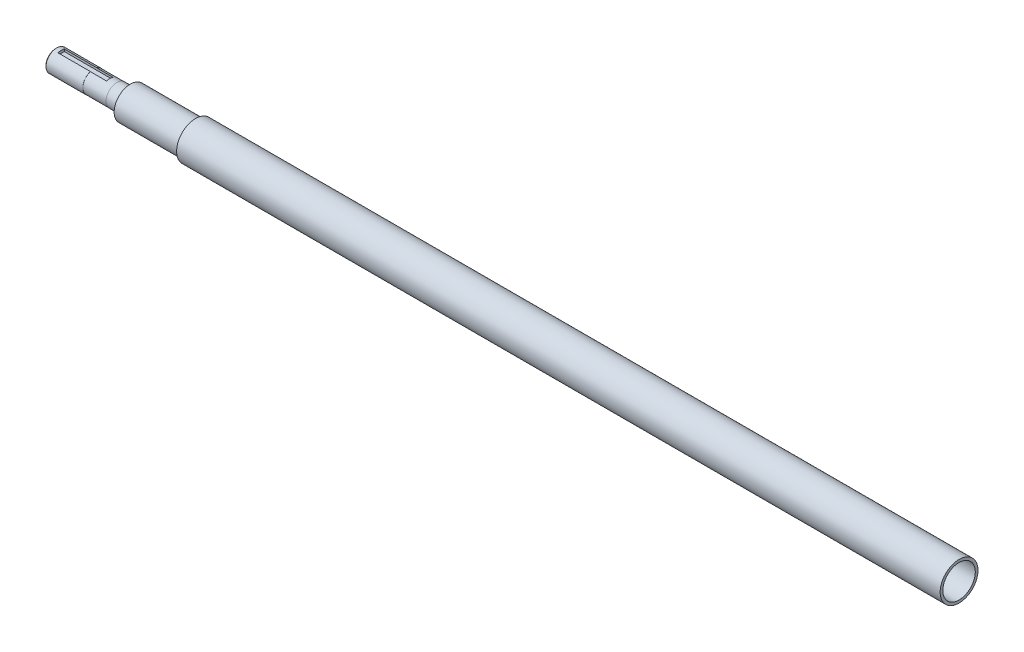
ISO-10303-21;
HEADER;
FILE_DESCRIPTION(('STEP AP214'),'2;1');
FILE_NAME('part.step','',(''),(''),'','','');
FILE_SCHEMA(('AUTOMOTIVE_DESIGN { 1 0 10303 214 1 1 1 1 }'));
ENDSEC;
DATA;
#1=APPLICATION_CONTEXT('core data for automotive mechanical design processes');
#2=APPLICATION_PROTOCOL_DEFINITION('international standard','automotive_design',2000,#1);
#3=PRODUCT_CONTEXT('',#1,'mechanical');
#4=PRODUCT('Part','Part','',(#3));
#5=PRODUCT_RELATED_PRODUCT_CATEGORY('part','',(#4));
#6=PRODUCT_DEFINITION_FORMATION('','',#4);
#7=PRODUCT_DEFINITION_CONTEXT('part definition',#1,'design');
#8=PRODUCT_DEFINITION('design','',#6,#7);
#9=PRODUCT_DEFINITION_SHAPE('','',#8);
#10=(LENGTH_UNIT() NAMED_UNIT(*) SI_UNIT(.MILLI.,.METRE.));
#11=(NAMED_UNIT(*) PLANE_ANGLE_UNIT() SI_UNIT($,.RADIAN.));
#12=(NAMED_UNIT(*) SI_UNIT($,.STERADIAN.) SOLID_ANGLE_UNIT());
#13=UNCERTAINTY_MEASURE_WITH_UNIT(LENGTH_MEASURE(1.E-05),#10,'distance_accuracy_value','');
#14=(GEOMETRIC_REPRESENTATION_CONTEXT(3) GLOBAL_UNCERTAINTY_ASSIGNED_CONTEXT((#13)) GLOBAL_UNIT_ASSIGNED_CONTEXT((#10,
#11,#12)) REPRESENTATION_CONTEXT('',''));
#15=CARTESIAN_POINT('',(0.,0.,0.));
#16=DIRECTION('',(0.,0.,1.));
#17=DIRECTION('',(1.,0.,0.));
#18=AXIS2_PLACEMENT_3D('',#15,#16,#17);
#19=CARTESIAN_POINT('',(-560.,20.,0.));
#20=DIRECTION('',(1.,0.,0.));
#21=DIRECTION('',(0.,0.,-1.));
#22=AXIS2_PLACEMENT_3D('',#19,#20,#21);
#23=PLANE('',#22);
#24=CARTESIAN_POINT('',(-560.,0.,0.));
#25=DIRECTION('',(1.,0.,0.));
#26=DIRECTION('',(0.,0.,-1.));
#27=AXIS2_PLACEMENT_3D('',#24,#25,#26);
#28=CIRCLE('',#27,19.8);
#29=CARTESIAN_POINT('',(-560.,18.8690222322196,6.));
#30=VERTEX_POINT('',#29);
#31=CARTESIAN_POINT('',(-560.,18.8690222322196,-6.));
#32=VERTEX_POINT('',#31);
#33=EDGE_CURVE('E135',#30,#32,#28,.T.);
#34=ORIENTED_EDGE('',*,*,#33,.F.);
#35=DIRECTION('',(0.,1.,0.));
#36=VECTOR('',#35,1.);
#37=CARTESIAN_POINT('',(-560.,20.,6.));
#38=LINE('',#37,#36);
#39=CARTESIAN_POINT('',(-560.,19.0787840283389,6.));
#40=VERTEX_POINT('',#39);
#41=EDGE_CURVE('E132',#30,#40,#38,.T.);
#42=ORIENTED_EDGE('',*,*,#41,.T.);
#43=CARTESIAN_POINT('',(-560.,0.,0.));
#44=DIRECTION('',(1.,0.,0.));
#45=DIRECTION('',(0.,0.,-1.));
#46=AXIS2_PLACEMENT_3D('',#43,#44,#45);
#47=CIRCLE('',#46,20.);
#48=CARTESIAN_POINT('',(-560.,19.0787840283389,-6.));
#49=VERTEX_POINT('',#48);
#50=EDGE_CURVE('E162',#40,#49,#47,.T.);
#51=ORIENTED_EDGE('',*,*,#50,.T.);
#52=DIRECTION('',(0.,-1.,0.));
#53=VECTOR('',#52,1.);
#54=CARTESIAN_POINT('',(-560.,20.,-6.));
#55=LINE('',#54,#53);
#56=EDGE_CURVE('E126',#49,#32,#55,.T.);
#57=ORIENTED_EDGE('',*,*,#56,.T.);
#58=EDGE_LOOP('',(#34,#42,#51,#57));
#59=FACE_BOUND('',#58,.T.);
#60=ADVANCED_FACE('F32',(#59),#23,.T.);
#61=CARTESIAN_POINT('',(1035.6434000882,0.,0.));
#62=DIRECTION('',(1.,0.,0.));
#63=DIRECTION('',(0.,0.,-1.));
#64=AXIS2_PLACEMENT_3D('',#61,#62,#63);
#65=CYLINDRICAL_SURFACE('',#64,20.);
#66=CARTESIAN_POINT('',(-628.,0.,0.));
#67=DIRECTION('',(-1.,0.,0.));
#68=DIRECTION('',(0.,0.,1.));
#69=AXIS2_PLACEMENT_3D('',#66,#67,#68);
#70=CIRCLE('',#69,20.);
#71=CARTESIAN_POINT('',(-628.,0.,20.));
#72=VERTEX_POINT('',#71);
#73=EDGE_CURVE('E176',#72,#72,#70,.F.);
#74=ORIENTED_EDGE('',*,*,#73,.T.);
#75=EDGE_LOOP('',(#74));
#76=FACE_BOUND('',#75,.T.);
#77=ORIENTED_EDGE('',*,*,#50,.F.);
#78=DIRECTION('',(1.,0.,0.));
#79=VECTOR('',#78,1.);
#80=CARTESIAN_POINT('',(1035.6434000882,19.0787840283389,6.));
#81=LINE('',#80,#79);
#82=CARTESIAN_POINT('',(-620.,19.0787840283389,6.));
#83=VERTEX_POINT('',#82);
#84=EDGE_CURVE('E54',#40,#83,#81,.F.);
#85=ORIENTED_EDGE('',*,*,#84,.T.);
#86=CARTESIAN_POINT('',(-620.,0.,0.));
#87=DIRECTION('',(1.,0.,0.));
#88=DIRECTION('',(0.,0.,-1.));
#89=AXIS2_PLACEMENT_3D('',#86,#87,#88);
#90=CIRCLE('',#89,20.);
#91=CARTESIAN_POINT('',(-620.,19.0787840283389,-6.));
#92=VERTEX_POINT('',#91);
#93=EDGE_CURVE('E173',#83,#92,#90,.F.);
#94=ORIENTED_EDGE('',*,*,#93,.T.);
#95=DIRECTION('',(1.,0.,0.));
#96=VECTOR('',#95,1.);
#97=CARTESIAN_POINT('',(1035.6434000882,19.0787840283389,-6.));
#98=LINE('',#97,#96);
#99=EDGE_CURVE('E129',#92,#49,#98,.T.);
#100=ORIENTED_EDGE('',*,*,#99,.T.);
#101=EDGE_LOOP('',(#77,#85,#94,#100));
#102=FACE_BOUND('',#101,.T.);
#103=ADVANCED_FACE('F197',(#76,#102),#65,.T.);
#104=CARTESIAN_POINT('',(1035.6434000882,0.,0.));
#105=DIRECTION('',(1.,0.,0.));
#106=DIRECTION('',(0.,0.,-1.));
#107=AXIS2_PLACEMENT_3D('',#104,#105,#106);
#108=CYLINDRICAL_SURFACE('',#107,19.8);
#109=CARTESIAN_POINT('',(-517.,0.,0.));
#110=DIRECTION('',(1.,0.,0.));
#111=DIRECTION('',(0.,0.,-1.));
#112=AXIS2_PLACEMENT_3D('',#109,#110,#111);
#113=CIRCLE('',#112,19.8);
#114=CARTESIAN_POINT('',(-517.,0.,-19.8));
#115=VERTEX_POINT('',#114);
#116=EDGE_CURVE('E138',#115,#115,#113,.T.);
#117=ORIENTED_EDGE('',*,*,#116,.F.);
#118=EDGE_LOOP('',(#117));
#119=FACE_BOUND('',#118,.T.);
#120=CARTESIAN_POINT('',(-530.,0.,0.));
#121=DIRECTION('',(1.,0.,0.));
#122=DIRECTION('',(0.,0.,-1.));
#123=AXIS2_PLACEMENT_3D('',#120,#121,#122);
#124=CIRCLE('',#123,19.8);
#125=CARTESIAN_POINT('',(-530.,18.8690222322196,6.));
#126=VERTEX_POINT('',#125);
#127=CARTESIAN_POINT('',(-530.,18.8690222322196,-6.));
#128=VERTEX_POINT('',#127);
#129=EDGE_CURVE('E165',#126,#128,#124,.F.);
#130=ORIENTED_EDGE('',*,*,#129,.F.);
#131=DIRECTION('',(1.,0.,0.));
#132=VECTOR('',#131,1.);
#133=CARTESIAN_POINT('',(1035.6434000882,18.8690222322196,6.));
#134=LINE('',#133,#132);
#135=EDGE_CURVE('E170',#126,#30,#134,.F.);
#136=ORIENTED_EDGE('',*,*,#135,.T.);
#137=ORIENTED_EDGE('',*,*,#33,.T.);
#138=DIRECTION('',(1.,0.,0.));
#139=VECTOR('',#138,1.);
#140=CARTESIAN_POINT('',(1035.6434000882,18.8690222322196,-6.));
#141=LINE('',#140,#139);
#142=EDGE_CURVE('E167',#32,#128,#141,.T.);
#143=ORIENTED_EDGE('',*,*,#142,.T.);
#144=EDGE_LOOP('',(#130,#136,#137,#143));
#145=FACE_BOUND('',#144,.T.);
#146=ADVANCED_FACE('F202',(#119,#145),#108,.T.);
#147=CARTESIAN_POINT('',(-630.,20.,0.));
#148=DIRECTION('',(-1.,0.,0.));
#149=DIRECTION('',(0.,0.,1.));
#150=AXIS2_PLACEMENT_3D('',#147,#148,#149);
#151=PLANE('',#150);
#152=CARTESIAN_POINT('',(-630.,0.,0.));
#153=DIRECTION('',(-1.,0.,0.));
#154=DIRECTION('',(0.,0.,1.));
#155=AXIS2_PLACEMENT_3D('',#152,#153,#154);
#156=CIRCLE('',#155,17.9999999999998);
#157=CARTESIAN_POINT('',(-630.,0.,17.9999999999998));
#158=VERTEX_POINT('',#157);
#159=EDGE_CURVE('E179',#158,#158,#156,.T.);
#160=ORIENTED_EDGE('',*,*,#159,.T.);
#161=EDGE_LOOP('',(#160));
#162=FACE_BOUND('',#161,.T.);
#163=CARTESIAN_POINT('',(-630.,0.,0.));
#164=DIRECTION('',(-1.,0.,0.));
#165=DIRECTION('',(0.,0.,1.));
#166=AXIS2_PLACEMENT_3D('',#163,#164,#165);
#167=CIRCLE('',#166,8.);
#168=CARTESIAN_POINT('',(-630.,0.,8.));
#169=VERTEX_POINT('',#168);
#170=EDGE_CURVE('E104',#169,#169,#167,.T.);
#171=ORIENTED_EDGE('',*,*,#170,.F.);
#172=EDGE_LOOP('',(#171));
#173=FACE_BOUND('',#172,.T.);
#174=ADVANCED_FACE('F237',(#162,#173),#151,.T.);
#175=CARTESIAN_POINT('',(630.,30.,0.));
#176=DIRECTION('',(1.,0.,0.));
#177=DIRECTION('',(0.,0.,-1.));
#178=AXIS2_PLACEMENT_3D('',#175,#176,#177);
#179=PLANE('',#178);
#180=CARTESIAN_POINT('',(630.,0.,0.));
#181=DIRECTION('',(1.,0.,0.));
#182=DIRECTION('',(0.,0.,-1.));
#183=AXIS2_PLACEMENT_3D('',#180,#181,#182);
#184=CIRCLE('',#183,28.);
#185=CARTESIAN_POINT('',(630.,0.,-28.));
#186=VERTEX_POINT('',#185);
#187=EDGE_CURVE('E39',#186,#186,#184,.T.);
#188=ORIENTED_EDGE('',*,*,#187,.T.);
#189=EDGE_LOOP('',(#188));
#190=FACE_BOUND('',#189,.T.);
#191=ADVANCED_FACE('F184',(#190),#179,.T.);
#192=CARTESIAN_POINT('',(1035.6434000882,0.,0.));
#193=DIRECTION('',(1.,0.,0.));
#194=DIRECTION('',(0.,0.,-1.));
#195=AXIS2_PLACEMENT_3D('',#192,#193,#194);
#196=CYLINDRICAL_SURFACE('',#195,30.);
#197=CARTESIAN_POINT('',(632.,0.,0.));
#198=DIRECTION('',(1.,0.,0.));
#199=DIRECTION('',(0.,0.,-1.));
#200=AXIS2_PLACEMENT_3D('',#197,#198,#199);
#201=CIRCLE('',#200,30.);
#202=CARTESIAN_POINT('',(632.,0.,-30.));
#203=VERTEX_POINT('',#202);
#204=EDGE_CURVE('E11',#203,#203,#201,.F.);
#205=ORIENTED_EDGE('',*,*,#204,.T.);
#206=EDGE_LOOP('',(#205));
#207=FACE_BOUND('',#206,.T.);
#208=CARTESIAN_POINT('',(1040.5,0.,0.));
#209=DIRECTION('',(1.,0.,0.));
#210=DIRECTION('',(0.,0.,-1.));
#211=AXIS2_PLACEMENT_3D('',#208,#209,#210);
#212=CIRCLE('',#211,30.);
#213=CARTESIAN_POINT('',(1040.5,0.,-30.));
#214=VERTEX_POINT('',#213);
#215=EDGE_CURVE('E159',#214,#214,#212,.T.);
#216=ORIENTED_EDGE('',*,*,#215,.T.);
#217=EDGE_LOOP('',(#216));
#218=FACE_BOUND('',#217,.T.);
#219=ADVANCED_FACE('F265',(#207,#218),#196,.F.);
#220=CARTESIAN_POINT('',(1040.5,35.,0.));
#221=DIRECTION('',(1.,0.,0.));
#222=DIRECTION('',(0.,0.,-1.));
#223=AXIS2_PLACEMENT_3D('',#220,#221,#222);
#224=PLANE('',#223);
#225=CARTESIAN_POINT('',(1040.5,0.,0.));
#226=DIRECTION('',(1.,0.,0.));
#227=DIRECTION('',(0.,0.,-1.));
#228=AXIS2_PLACEMENT_3D('',#225,#226,#227);
#229=CIRCLE('',#228,35.);
#230=CARTESIAN_POINT('',(1040.5,0.,-35.));
#231=VERTEX_POINT('',#230);
#232=EDGE_CURVE('E156',#231,#231,#229,.T.);
#233=ORIENTED_EDGE('',*,*,#232,.T.);
#234=EDGE_LOOP('',(#233));
#235=FACE_BOUND('',#234,.T.);
#236=ORIENTED_EDGE('',*,*,#215,.F.);
#237=EDGE_LOOP('',(#236));
#238=FACE_BOUND('',#237,.T.);
#239=ADVANCED_FACE('F261',(#235,#238),#224,.T.);
#240=CARTESIAN_POINT('',(1035.6434000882,0.,0.));
#241=DIRECTION('',(1.,0.,0.));
#242=DIRECTION('',(0.,0.,-1.));
#243=AXIS2_PLACEMENT_3D('',#240,#241,#242);
#244=CYLINDRICAL_SURFACE('',#243,35.);
#245=CARTESIAN_POINT('',(-371.5,0.,0.));
#246=DIRECTION('',(1.,0.,0.));
#247=DIRECTION('',(0.,0.,-1.));
#248=AXIS2_PLACEMENT_3D('',#245,#246,#247);
#249=CIRCLE('',#248,35.);
#250=CARTESIAN_POINT('',(-371.5,0.,-35.));
#251=VERTEX_POINT('',#250);
#252=EDGE_CURVE('E153',#251,#251,#249,.T.);
#253=ORIENTED_EDGE('',*,*,#252,.T.);
#254=EDGE_LOOP('',(#253));
#255=FACE_BOUND('',#254,.T.);
#256=ORIENTED_EDGE('',*,*,#232,.F.);
#257=EDGE_LOOP('',(#256));
#258=FACE_BOUND('',#257,.T.);
#259=ADVANCED_FACE('F257',(#255,#258),#244,.T.);
#260=CARTESIAN_POINT('',(-371.5,35.,0.));
#261=DIRECTION('',(-1.,0.,0.));
#262=DIRECTION('',(0.,0.,1.));
#263=AXIS2_PLACEMENT_3D('',#260,#261,#262);
#264=PLANE('',#263);
#265=CARTESIAN_POINT('',(-371.5,0.,0.));
#266=DIRECTION('',(1.,0.,0.));
#267=DIRECTION('',(0.,0.,-1.));
#268=AXIS2_PLACEMENT_3D('',#265,#266,#267);
#269=CIRCLE('',#268,30.);
#270=CARTESIAN_POINT('',(-371.5,0.,-30.));
#271=VERTEX_POINT('',#270);
#272=EDGE_CURVE('E150',#271,#271,#269,.T.);
#273=ORIENTED_EDGE('',*,*,#272,.T.);
#274=EDGE_LOOP('',(#273));
#275=FACE_BOUND('',#274,.T.);
#276=ORIENTED_EDGE('',*,*,#252,.F.);
#277=EDGE_LOOP('',(#276));
#278=FACE_BOUND('',#277,.T.);
#279=ADVANCED_FACE('F253',(#275,#278),#264,.T.);
#280=CARTESIAN_POINT('',(1035.6434000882,0.,0.));
#281=DIRECTION('',(1.,0.,0.));
#282=DIRECTION('',(0.,0.,-1.));
#283=AXIS2_PLACEMENT_3D('',#280,#281,#282);
#284=CYLINDRICAL_SURFACE('',#283,30.);
#285=CARTESIAN_POINT('',(-492.,0.,0.));
#286=DIRECTION('',(1.,0.,0.));
#287=DIRECTION('',(0.,0.,-1.));
#288=AXIS2_PLACEMENT_3D('',#285,#286,#287);
#289=CIRCLE('',#288,30.);
#290=CARTESIAN_POINT('',(-492.,0.,-30.));
#291=VERTEX_POINT('',#290);
#292=EDGE_CURVE('E147',#291,#291,#289,.T.);
#293=ORIENTED_EDGE('',*,*,#292,.T.);
#294=EDGE_LOOP('',(#293));
#295=FACE_BOUND('',#294,.T.);
#296=ORIENTED_EDGE('',*,*,#272,.F.);
#297=EDGE_LOOP('',(#296));
#298=FACE_BOUND('',#297,.T.);
#299=ADVANCED_FACE('F249',(#295,#298),#284,.T.);
#300=CARTESIAN_POINT('',(-492.,30.,0.));
#301=DIRECTION('',(-1.,0.,0.));
#302=DIRECTION('',(0.,0.,1.));
#303=AXIS2_PLACEMENT_3D('',#300,#301,#302);
#304=PLANE('',#303);
#305=CARTESIAN_POINT('',(-492.,0.,0.));
#306=DIRECTION('',(1.,0.,0.));
#307=DIRECTION('',(0.,0.,-1.));
#308=AXIS2_PLACEMENT_3D('',#305,#306,#307);
#309=CIRCLE('',#308,20.);
#310=CARTESIAN_POINT('',(-492.,0.,-20.));
#311=VERTEX_POINT('',#310);
#312=EDGE_CURVE('E144',#311,#311,#309,.T.);
#313=ORIENTED_EDGE('',*,*,#312,.T.);
#314=EDGE_LOOP('',(#313));
#315=FACE_BOUND('',#314,.T.);
#316=ORIENTED_EDGE('',*,*,#292,.F.);
#317=EDGE_LOOP('',(#316));
#318=FACE_BOUND('',#317,.T.);
#319=ADVANCED_FACE('F245',(#315,#318),#304,.T.);
#320=CARTESIAN_POINT('',(1035.6434000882,0.,0.));
#321=DIRECTION('',(1.,0.,0.));
#322=DIRECTION('',(0.,0.,-1.));
#323=AXIS2_PLACEMENT_3D('',#320,#321,#322);
#324=CYLINDRICAL_SURFACE('',#323,20.);
#325=CARTESIAN_POINT('',(-517.,0.,0.));
#326=DIRECTION('',(1.,0.,0.));
#327=DIRECTION('',(0.,0.,-1.));
#328=AXIS2_PLACEMENT_3D('',#325,#326,#327);
#329=CIRCLE('',#328,20.);
#330=CARTESIAN_POINT('',(-517.,0.,-20.));
#331=VERTEX_POINT('',#330);
#332=EDGE_CURVE('E141',#331,#331,#329,.T.);
#333=ORIENTED_EDGE('',*,*,#332,.T.);
#334=EDGE_LOOP('',(#333));
#335=FACE_BOUND('',#334,.T.);
#336=ORIENTED_EDGE('',*,*,#312,.F.);
#337=EDGE_LOOP('',(#336));
#338=FACE_BOUND('',#337,.T.);
#339=ADVANCED_FACE('F241',(#335,#338),#324,.T.);
#340=CARTESIAN_POINT('',(-517.,20.,0.));
#341=DIRECTION('',(-1.,0.,0.));
#342=DIRECTION('',(0.,0.,1.));
#343=AXIS2_PLACEMENT_3D('',#340,#341,#342);
#344=PLANE('',#343);
#345=ORIENTED_EDGE('',*,*,#116,.T.);
#346=EDGE_LOOP('',(#345));
#347=FACE_BOUND('',#346,.T.);
#348=ORIENTED_EDGE('',*,*,#332,.F.);
#349=EDGE_LOOP('',(#348));
#350=FACE_BOUND('',#349,.T.);
#351=ADVANCED_FACE('F234',(#347,#350),#344,.T.);
#352=CARTESIAN_POINT('',(-530.,21.,6.));
#353=DIRECTION('',(0.,0.,-1.));
#354=DIRECTION('',(-1.,0.,0.));
#355=AXIS2_PLACEMENT_3D('',#352,#353,#354);
#356=PLANE('',#355);
#357=ORIENTED_EDGE('',*,*,#41,.F.);
#358=ORIENTED_EDGE('',*,*,#135,.F.);
#359=DIRECTION('',(0.,-1.,0.));
#360=VECTOR('',#359,1.);
#361=CARTESIAN_POINT('',(-530.,21.,6.));
#362=LINE('',#361,#360);
#363=CARTESIAN_POINT('',(-530.,15.,6.));
#364=VERTEX_POINT('',#363);
#365=EDGE_CURVE('E46',#126,#364,#362,.T.);
#366=ORIENTED_EDGE('',*,*,#365,.T.);
#367=DIRECTION('',(-1.,0.,0.));
#368=VECTOR('',#367,1.);
#369=CARTESIAN_POINT('',(-530.,15.,6.));
#370=LINE('',#369,#368);
#371=CARTESIAN_POINT('',(-620.,15.,6.));
#372=VERTEX_POINT('',#371);
#373=EDGE_CURVE('E123',#364,#372,#370,.T.);
#374=ORIENTED_EDGE('',*,*,#373,.T.);
#375=DIRECTION('',(0.,-1.,0.));
#376=VECTOR('',#375,1.);
#377=CARTESIAN_POINT('',(-620.,21.,6.));
#378=LINE('',#377,#376);
#379=EDGE_CURVE('E107',#83,#372,#378,.T.);
#380=ORIENTED_EDGE('',*,*,#379,.F.);
#381=ORIENTED_EDGE('',*,*,#84,.F.);
#382=EDGE_LOOP('',(#357,#358,#366,#374,#380,#381));
#383=FACE_BOUND('',#382,.T.);
#384=ADVANCED_FACE('F208',(#383),#356,.T.);
#385=CARTESIAN_POINT('',(-530.,15.,6.));
#386=DIRECTION('',(0.,1.,0.));
#387=DIRECTION('',(0.,0.,1.));
#388=AXIS2_PLACEMENT_3D('',#385,#386,#387);
#389=PLANE('',#388);
#390=DIRECTION('',(0.,0.,-1.));
#391=VECTOR('',#390,1.);
#392=CARTESIAN_POINT('',(-620.,15.,6.));
#393=LINE('',#392,#391);
#394=CARTESIAN_POINT('',(-620.,15.,-6.));
#395=VERTEX_POINT('',#394);
#396=EDGE_CURVE('E109',#372,#395,#393,.T.);
#397=ORIENTED_EDGE('',*,*,#396,.F.);
#398=ORIENTED_EDGE('',*,*,#373,.F.);
#399=DIRECTION('',(0.,0.,-1.));
#400=VECTOR('',#399,1.);
#401=CARTESIAN_POINT('',(-530.,15.,6.));
#402=LINE('',#401,#400);
#403=CARTESIAN_POINT('',(-530.,15.,-6.));
#404=VERTEX_POINT('',#403);
#405=EDGE_CURVE('E115',#364,#404,#402,.T.);
#406=ORIENTED_EDGE('',*,*,#405,.T.);
#407=DIRECTION('',(-1.,0.,0.));
#408=VECTOR('',#407,1.);
#409=CARTESIAN_POINT('',(-530.,15.,-6.));
#410=LINE('',#409,#408);
#411=EDGE_CURVE('E120',#404,#395,#410,.T.);
#412=ORIENTED_EDGE('',*,*,#411,.T.);
#413=EDGE_LOOP('',(#397,#398,#406,#412));
#414=FACE_BOUND('',#413,.T.);
#415=ADVANCED_FACE('F215',(#414),#389,.T.);
#416=CARTESIAN_POINT('',(-530.,21.,-6.));
#417=DIRECTION('',(0.,0.,1.));
#418=DIRECTION('',(0.,-1.,0.));
#419=AXIS2_PLACEMENT_3D('',#416,#417,#418);
#420=PLANE('',#419);
#421=DIRECTION('',(0.,1.,0.));
#422=VECTOR('',#421,1.);
#423=CARTESIAN_POINT('',(-620.,21.,-6.));
#424=LINE('',#423,#422);
#425=EDGE_CURVE('E111',#395,#92,#424,.T.);
#426=ORIENTED_EDGE('',*,*,#425,.F.);
#427=ORIENTED_EDGE('',*,*,#411,.F.);
#428=DIRECTION('',(0.,1.,0.));
#429=VECTOR('',#428,1.);
#430=CARTESIAN_POINT('',(-530.,21.,-6.));
#431=LINE('',#430,#429);
#432=EDGE_CURVE('E117',#404,#128,#431,.T.);
#433=ORIENTED_EDGE('',*,*,#432,.T.);
#434=ORIENTED_EDGE('',*,*,#142,.F.);
#435=ORIENTED_EDGE('',*,*,#56,.F.);
#436=ORIENTED_EDGE('',*,*,#99,.F.);
#437=EDGE_LOOP('',(#426,#427,#433,#434,#435,#436));
#438=FACE_BOUND('',#437,.T.);
#439=ADVANCED_FACE('F221',(#438),#420,.T.);
#440=CARTESIAN_POINT('',(-530.,15.,6.));
#441=DIRECTION('',(1.,0.,0.));
#442=DIRECTION('',(0.,0.,-1.));
#443=AXIS2_PLACEMENT_3D('',#440,#441,#442);
#444=PLANE('',#443);
#445=ORIENTED_EDGE('',*,*,#129,.T.);
#446=ORIENTED_EDGE('',*,*,#432,.F.);
#447=ORIENTED_EDGE('',*,*,#405,.F.);
#448=ORIENTED_EDGE('',*,*,#365,.F.);
#449=EDGE_LOOP('',(#445,#446,#447,#448));
#450=FACE_BOUND('',#449,.T.);
#451=ADVANCED_FACE('F211',(#450),#444,.F.);
#452=CARTESIAN_POINT('',(-620.,15.,6.));
#453=DIRECTION('',(1.,0.,0.));
#454=DIRECTION('',(0.,0.,-1.));
#455=AXIS2_PLACEMENT_3D('',#452,#453,#454);
#456=PLANE('',#455);
#457=ORIENTED_EDGE('',*,*,#379,.T.);
#458=ORIENTED_EDGE('',*,*,#396,.T.);
#459=ORIENTED_EDGE('',*,*,#425,.T.);
#460=ORIENTED_EDGE('',*,*,#93,.F.);
#461=EDGE_LOOP('',(#457,#458,#459,#460));
#462=FACE_BOUND('',#461,.T.);
#463=ADVANCED_FACE('F218',(#462),#456,.T.);
#464=CARTESIAN_POINT('',(-630.,0.,0.));
#465=DIRECTION('',(-1.,0.,0.));
#466=DIRECTION('',(0.,0.,1.));
#467=AXIS2_PLACEMENT_3D('',#464,#465,#466);
#468=CYLINDRICAL_SURFACE('',#467,7.99999999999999);
#469=CARTESIAN_POINT('',(-590.,0.,0.));
#470=DIRECTION('',(-1.,0.,0.));
#471=DIRECTION('',(0.,0.,1.));
#472=AXIS2_PLACEMENT_3D('',#469,#470,#471);
#473=CIRCLE('',#472,7.99999999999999);
#474=CARTESIAN_POINT('',(-590.,0.,7.99999999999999));
#475=VERTEX_POINT('',#474);
#476=EDGE_CURVE('E99',#475,#475,#473,.T.);
#477=ORIENTED_EDGE('',*,*,#476,.F.);
#478=EDGE_LOOP('',(#477));
#479=FACE_BOUND('',#478,.T.);
#480=ORIENTED_EDGE('',*,*,#170,.T.);
#481=EDGE_LOOP('',(#480));
#482=FACE_BOUND('',#481,.T.);
#483=ADVANCED_FACE('F280',(#479,#482),#468,.F.);
#484=CARTESIAN_POINT('',(-590.,6.99999999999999,0.));
#485=DIRECTION('',(1.,0.,0.));
#486=DIRECTION('',(0.,0.,-1.));
#487=AXIS2_PLACEMENT_3D('',#484,#485,#486);
#488=PLANE('',#487);
#489=CARTESIAN_POINT('',(-590.,0.,0.));
#490=DIRECTION('',(-1.,0.,0.));
#491=DIRECTION('',(0.,0.,1.));
#492=AXIS2_PLACEMENT_3D('',#489,#490,#491);
#493=CIRCLE('',#492,6.99999999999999);
#494=CARTESIAN_POINT('',(-590.,0.,6.99999999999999));
#495=VERTEX_POINT('',#494);
#496=EDGE_CURVE('E96',#495,#495,#493,.T.);
#497=ORIENTED_EDGE('',*,*,#496,.F.);
#498=EDGE_LOOP('',(#497));
#499=FACE_BOUND('',#498,.T.);
#500=ORIENTED_EDGE('',*,*,#476,.T.);
#501=EDGE_LOOP('',(#500));
#502=FACE_BOUND('',#501,.T.);
#503=ADVANCED_FACE('F282',(#499,#502),#488,.F.);
#504=CARTESIAN_POINT('',(-630.,0.,0.));
#505=DIRECTION('',(-1.,0.,0.));
#506=DIRECTION('',(0.,0.,1.));
#507=AXIS2_PLACEMENT_3D('',#504,#505,#506);
#508=CYLINDRICAL_SURFACE('',#507,6.99999999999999);
#509=CARTESIAN_POINT('',(-580.,0.,0.));
#510=DIRECTION('',(-1.,0.,0.));
#511=DIRECTION('',(0.,0.,1.));
#512=AXIS2_PLACEMENT_3D('',#509,#510,#511);
#513=CIRCLE('',#512,6.99999999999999);
#514=CARTESIAN_POINT('',(-580.,0.,6.99999999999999));
#515=VERTEX_POINT('',#514);
#516=EDGE_CURVE('E94',#515,#515,#513,.T.);
#517=ORIENTED_EDGE('',*,*,#516,.F.);
#518=EDGE_LOOP('',(#517));
#519=FACE_BOUND('',#518,.T.);
#520=ORIENTED_EDGE('',*,*,#496,.T.);
#521=EDGE_LOOP('',(#520));
#522=FACE_BOUND('',#521,.T.);
#523=ADVANCED_FACE('F90',(#519,#522),#508,.F.);
#524=CARTESIAN_POINT('',(-580.,0.,0.));
#525=DIRECTION('',(-1.,0.,0.));
#526=DIRECTION('',(0.,0.,1.));
#527=AXIS2_PLACEMENT_3D('',#524,#525,#526);
#528=CONICAL_SURFACE('',#527,6.99999999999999,1.02974425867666);
#529=CARTESIAN_POINT('',(-575.793975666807,0.,0.));
#530=VERTEX_POINT('',#529);
#531=VERTEX_LOOP('',#530);
#532=FACE_BOUND('',#531,.T.);
#533=ORIENTED_EDGE('',*,*,#516,.T.);
#534=EDGE_LOOP('',(#533));
#535=FACE_BOUND('',#534,.T.);
#536=ADVANCED_FACE('F86',(#532,#535),#528,.F.);
#537=CARTESIAN_POINT('',(-628.,0.,0.));
#538=DIRECTION('',(1.,0.,0.));
#539=DIRECTION('',(0.,0.,-1.));
#540=AXIS2_PLACEMENT_3D('',#537,#538,#539);
#541=CONICAL_SURFACE('',#540,20.,0.785398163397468);
#542=ORIENTED_EDGE('',*,*,#159,.F.);
#543=EDGE_LOOP('',(#542));
#544=FACE_BOUND('',#543,.T.);
#545=ORIENTED_EDGE('',*,*,#73,.F.);
#546=EDGE_LOOP('',(#545));
#547=FACE_BOUND('',#546,.T.);
#548=ADVANCED_FACE('F89',(#544,#547),#541,.T.);
#549=CARTESIAN_POINT('',(630.,0.,0.));
#550=DIRECTION('',(1.,0.,0.));
#551=DIRECTION('',(0.,0.,-1.));
#552=AXIS2_PLACEMENT_3D('',#549,#550,#551);
#553=CONICAL_SURFACE('',#552,28.,0.785398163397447);
#554=ORIENTED_EDGE('',*,*,#204,.F.);
#555=EDGE_LOOP('',(#554));
#556=FACE_BOUND('',#555,.T.);
#557=ORIENTED_EDGE('',*,*,#187,.F.);
#558=EDGE_LOOP('',(#557));
#559=FACE_BOUND('',#558,.T.);
#560=ADVANCED_FACE('F186',(#556,#559),#553,.F.);
#561=CLOSED_SHELL('',(#60,#103,#146,#174,#191,#219,#239,#259,#279,#299,#319,#339,#351,#384,#415,
#439,#451,#463,#483,#503,#523,#536,#548,#560));
#562=MANIFOLD_SOLID_BREP('B2',#561);
#563=ADVANCED_BREP_SHAPE_REPRESENTATION('',(#18,#562),#14);
#564=SHAPE_DEFINITION_REPRESENTATION(#9,#563);
ENDSEC;
END-ISO-10303-21;
